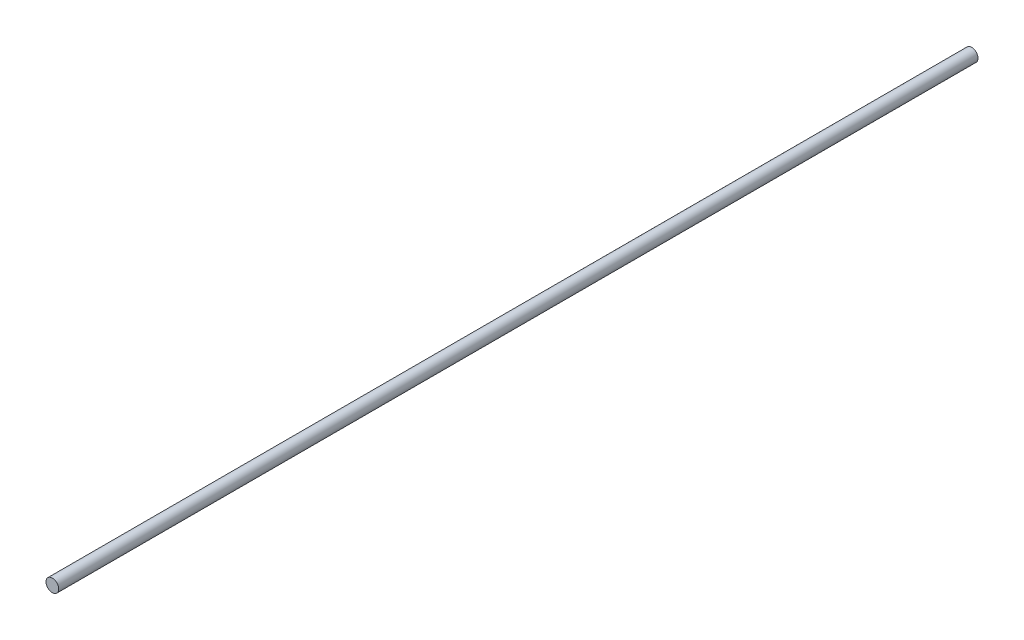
ISO-10303-21;
HEADER;
FILE_DESCRIPTION(('STEP AP214'),'2;1');
FILE_NAME('part.step','',(''),(''),'','','');
FILE_SCHEMA(('AUTOMOTIVE_DESIGN { 1 0 10303 214 1 1 1 1 }'));
ENDSEC;
DATA;
#1=APPLICATION_CONTEXT('core data for automotive mechanical design processes');
#2=APPLICATION_PROTOCOL_DEFINITION('international standard','automotive_design',2000,#1);
#3=PRODUCT_CONTEXT('',#1,'mechanical');
#4=PRODUCT('Part','Part','',(#3));
#5=PRODUCT_RELATED_PRODUCT_CATEGORY('part','',(#4));
#6=PRODUCT_DEFINITION_FORMATION('','',#4);
#7=PRODUCT_DEFINITION_CONTEXT('part definition',#1,'design');
#8=PRODUCT_DEFINITION('design','',#6,#7);
#9=PRODUCT_DEFINITION_SHAPE('','',#8);
#10=(LENGTH_UNIT() NAMED_UNIT(*) SI_UNIT(.MILLI.,.METRE.));
#11=(NAMED_UNIT(*) PLANE_ANGLE_UNIT() SI_UNIT($,.RADIAN.));
#12=(NAMED_UNIT(*) SI_UNIT($,.STERADIAN.) SOLID_ANGLE_UNIT());
#13=UNCERTAINTY_MEASURE_WITH_UNIT(LENGTH_MEASURE(1.E-05),#10,'distance_accuracy_value','');
#14=(GEOMETRIC_REPRESENTATION_CONTEXT(3) GLOBAL_UNCERTAINTY_ASSIGNED_CONTEXT((#13)) GLOBAL_UNIT_ASSIGNED_CONTEXT((#10,
#11,#12)) REPRESENTATION_CONTEXT('',''));
#15=CARTESIAN_POINT('',(0.,0.,0.));
#16=DIRECTION('',(0.,0.,1.));
#17=DIRECTION('',(1.,0.,0.));
#18=AXIS2_PLACEMENT_3D('',#15,#16,#17);
#19=CARTESIAN_POINT('',(0.,0.,-4350.));
#20=DIRECTION('',(0.,0.,1.));
#21=DIRECTION('',(1.,0.,0.));
#22=AXIS2_PLACEMENT_3D('',#19,#20,#21);
#23=CYLINDRICAL_SURFACE('',#22,30.);
#24=CARTESIAN_POINT('',(0.,0.,-4350.));
#25=DIRECTION('',(0.,0.,1.));
#26=DIRECTION('',(1.,0.,0.));
#27=AXIS2_PLACEMENT_3D('',#24,#25,#26);
#28=CIRCLE('',#27,30.);
#29=CARTESIAN_POINT('',(30.,0.,-4350.));
#30=VERTEX_POINT('',#29);
#31=EDGE_CURVE('E10',#30,#30,#28,.T.);
#32=ORIENTED_EDGE('',*,*,#31,.T.);
#33=EDGE_LOOP('',(#32));
#34=FACE_BOUND('',#33,.T.);
#35=CARTESIAN_POINT('',(0.,0.,0.));
#36=DIRECTION('',(0.,0.,1.));
#37=DIRECTION('',(1.,0.,0.));
#38=AXIS2_PLACEMENT_3D('',#35,#36,#37);
#39=CIRCLE('',#38,30.);
#40=CARTESIAN_POINT('',(30.,0.,0.));
#41=VERTEX_POINT('',#40);
#42=EDGE_CURVE('E40',#41,#41,#39,.T.);
#43=ORIENTED_EDGE('',*,*,#42,.F.);
#44=EDGE_LOOP('',(#43));
#45=FACE_BOUND('',#44,.T.);
#46=ADVANCED_FACE('F37',(#34,#45),#23,.T.);
#47=CARTESIAN_POINT('',(0.,0.,-4350.));
#48=DIRECTION('',(0.,0.,1.));
#49=DIRECTION('',(1.,0.,0.));
#50=AXIS2_PLACEMENT_3D('',#47,#48,#49);
#51=PLANE('',#50);
#52=ORIENTED_EDGE('',*,*,#31,.F.);
#53=EDGE_LOOP('',(#52));
#54=FACE_BOUND('',#53,.T.);
#55=ADVANCED_FACE('F54',(#54),#51,.F.);
#56=CARTESIAN_POINT('',(0.,0.,0.));
#57=DIRECTION('',(0.,0.,1.));
#58=DIRECTION('',(1.,0.,0.));
#59=AXIS2_PLACEMENT_3D('',#56,#57,#58);
#60=PLANE('',#59);
#61=ORIENTED_EDGE('',*,*,#42,.T.);
#62=EDGE_LOOP('',(#61));
#63=FACE_BOUND('',#62,.T.);
#64=ADVANCED_FACE('F51',(#63),#60,.T.);
#65=CLOSED_SHELL('',(#46,#55,#64));
#66=MANIFOLD_SOLID_BREP('B2',#65);
#67=ADVANCED_BREP_SHAPE_REPRESENTATION('',(#18,#66),#14);
#68=SHAPE_DEFINITION_REPRESENTATION(#9,#67);
ENDSEC;
END-ISO-10303-21;
